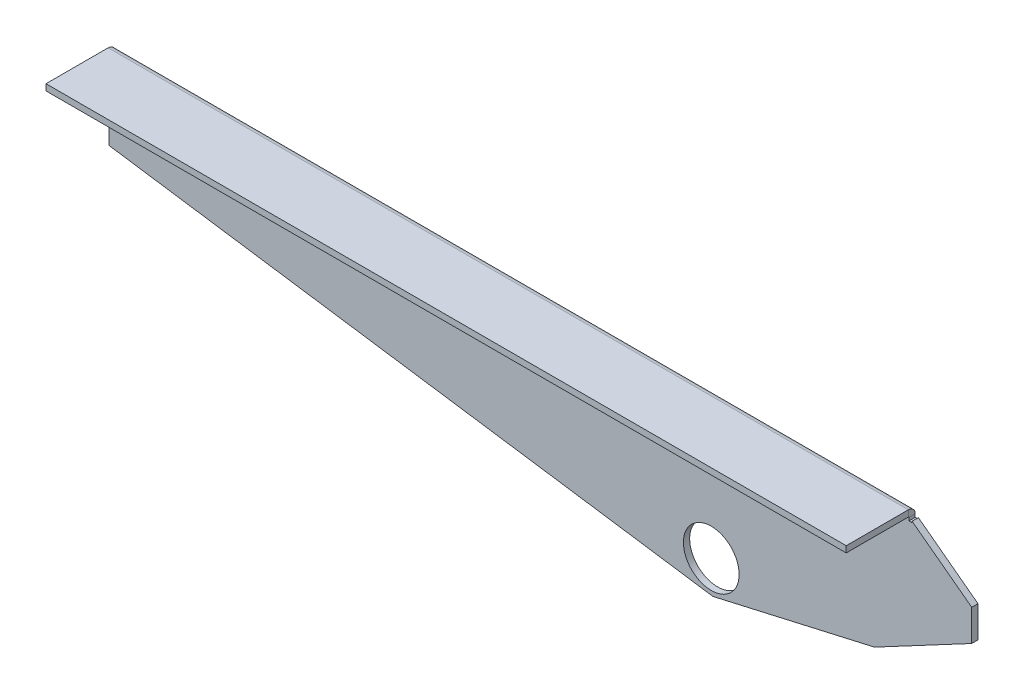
ISO-10303-21;
HEADER;
FILE_DESCRIPTION(('STEP AP214'),'2;1');
FILE_NAME('part.step','',(''),(''),'','','');
FILE_SCHEMA(('AUTOMOTIVE_DESIGN { 1 0 10303 214 1 1 1 1 }'));
ENDSEC;
DATA;
#1=APPLICATION_CONTEXT('core data for automotive mechanical design processes');
#2=APPLICATION_PROTOCOL_DEFINITION('international standard','automotive_design',2000,#1);
#3=PRODUCT_CONTEXT('',#1,'mechanical');
#4=PRODUCT('Part','Part','',(#3));
#5=PRODUCT_RELATED_PRODUCT_CATEGORY('part','',(#4));
#6=PRODUCT_DEFINITION_FORMATION('','',#4);
#7=PRODUCT_DEFINITION_CONTEXT('part definition',#1,'design');
#8=PRODUCT_DEFINITION('design','',#6,#7);
#9=PRODUCT_DEFINITION_SHAPE('','',#8);
#10=(LENGTH_UNIT() NAMED_UNIT(*) SI_UNIT(.MILLI.,.METRE.));
#11=(NAMED_UNIT(*) PLANE_ANGLE_UNIT() SI_UNIT($,.RADIAN.));
#12=(NAMED_UNIT(*) SI_UNIT($,.STERADIAN.) SOLID_ANGLE_UNIT());
#13=UNCERTAINTY_MEASURE_WITH_UNIT(LENGTH_MEASURE(1.E-05),#10,'distance_accuracy_value','');
#14=(GEOMETRIC_REPRESENTATION_CONTEXT(3) GLOBAL_UNCERTAINTY_ASSIGNED_CONTEXT((#13)) GLOBAL_UNIT_ASSIGNED_CONTEXT((#10,
#11,#12)) REPRESENTATION_CONTEXT('',''));
#15=CARTESIAN_POINT('',(0.,0.,0.));
#16=DIRECTION('',(0.,0.,1.));
#17=DIRECTION('',(1.,0.,0.));
#18=AXIS2_PLACEMENT_3D('',#15,#16,#17);
#19=CARTESIAN_POINT('',(0.,0.,8.));
#20=DIRECTION('',(0.,0.,-1.));
#21=DIRECTION('',(-1.,0.,0.));
#22=AXIS2_PLACEMENT_3D('',#19,#20,#21);
#23=PLANE('',#22);
#24=CARTESIAN_POINT('',(768.,-172.,8.));
#25=DIRECTION('',(0.,0.,1.));
#26=DIRECTION('',(1.,0.,0.));
#27=AXIS2_PLACEMENT_3D('',#24,#25,#26);
#28=CIRCLE('',#27,35.5);
#29=CARTESIAN_POINT('',(803.5,-172.,8.));
#30=VERTEX_POINT('',#29);
#31=EDGE_CURVE('E227',#30,#30,#28,.T.);
#32=ORIENTED_EDGE('',*,*,#31,.F.);
#33=EDGE_LOOP('',(#32));
#34=FACE_BOUND('',#33,.T.);
#35=DIRECTION('',(-1.,0.,0.));
#36=VECTOR('',#35,1.);
#37=CARTESIAN_POINT('',(0.,-0.736599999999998,7.99999999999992));
#38=LINE('',#37,#36);
#39=CARTESIAN_POINT('',(0.,-0.736599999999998,7.99999999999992));
#40=VERTEX_POINT('',#39);
#41=CARTESIAN_POINT('',(1020.,-0.736600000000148,7.99999999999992));
#42=VERTEX_POINT('',#41);
#43=EDGE_CURVE('E189',#40,#42,#38,.F.);
#44=ORIENTED_EDGE('',*,*,#43,.F.);
#45=DIRECTION('',(0.,-1.,0.));
#46=VECTOR('',#45,1.);
#47=CARTESIAN_POINT('',(0.,-100.,8.));
#48=LINE('',#47,#46);
#49=CARTESIAN_POINT('',(0.,-100.,8.));
#50=VERTEX_POINT('',#49);
#51=EDGE_CURVE('E242',#40,#50,#48,.T.);
#52=ORIENTED_EDGE('',*,*,#51,.T.);
#53=DIRECTION('',(0.989402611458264,-0.145198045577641,0.));
#54=VECTOR('',#53,1.);
#55=CARTESIAN_POINT('',(770.,-213.,8.));
#56=LINE('',#55,#54);
#57=CARTESIAN_POINT('',(770.,-213.,8.));
#58=VERTEX_POINT('',#57);
#59=EDGE_CURVE('E244',#50,#58,#56,.T.);
#60=ORIENTED_EDGE('',*,*,#59,.T.);
#61=DIRECTION('',(0.974946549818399,0.222439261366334,0.));
#62=VECTOR('',#61,1.);
#63=CARTESIAN_POINT('',(976.,-166.,8.));
#64=LINE('',#63,#62);
#65=CARTESIAN_POINT('',(976.,-166.,8.));
#66=VERTEX_POINT('',#65);
#67=EDGE_CURVE('E246',#58,#66,#64,.T.);
#68=ORIENTED_EDGE('',*,*,#67,.T.);
#69=DIRECTION('',(0.882746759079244,0.469849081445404,0.));
#70=VECTOR('',#69,1.);
#71=CARTESIAN_POINT('',(1100.,-100.,8.));
#72=LINE('',#71,#70);
#73=CARTESIAN_POINT('',(1100.,-100.,8.));
#74=VERTEX_POINT('',#73);
#75=EDGE_CURVE('E248',#66,#74,#72,.T.);
#76=ORIENTED_EDGE('',*,*,#75,.T.);
#77=DIRECTION('',(0.,1.,0.));
#78=VECTOR('',#77,1.);
#79=CARTESIAN_POINT('',(1100.,-60.,8.));
#80=LINE('',#79,#78);
#81=CARTESIAN_POINT('',(1100.,-60.,8.));
#82=VERTEX_POINT('',#81);
#83=EDGE_CURVE('E250',#74,#82,#80,.T.);
#84=ORIENTED_EDGE('',*,*,#83,.T.);
#85=DIRECTION('',(-0.8,0.6,0.));
#86=VECTOR('',#85,1.);
#87=CARTESIAN_POINT('',(1020.,0.,8.));
#88=LINE('',#87,#86);
#89=CARTESIAN_POINT('',(1024.,-3.,8.));
#90=VERTEX_POINT('',#89);
#91=EDGE_CURVE('E252',#82,#90,#88,.T.);
#92=ORIENTED_EDGE('',*,*,#91,.T.);
#93=DIRECTION('',(0.,1.,0.));
#94=VECTOR('',#93,1.);
#95=CARTESIAN_POINT('',(1024.,-4.73660000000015,7.99999999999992));
#96=LINE('',#95,#94);
#97=CARTESIAN_POINT('',(1024.,-4.73660000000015,8.));
#98=VERTEX_POINT('',#97);
#99=EDGE_CURVE('E67',#98,#90,#96,.T.);
#100=ORIENTED_EDGE('',*,*,#99,.F.);
#101=DIRECTION('',(1.,0.,0.));
#102=VECTOR('',#101,1.);
#103=CARTESIAN_POINT('',(1020.,-4.73660000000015,7.99999999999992));
#104=LINE('',#103,#102);
#105=CARTESIAN_POINT('',(1020.,-4.73660000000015,8.));
#106=VERTEX_POINT('',#105);
#107=EDGE_CURVE('E62',#106,#98,#104,.T.);
#108=ORIENTED_EDGE('',*,*,#107,.F.);
#109=DIRECTION('',(0.,-1.,0.));
#110=VECTOR('',#109,1.);
#111=CARTESIAN_POINT('',(1020.,-0.736600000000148,7.99999999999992));
#112=LINE('',#111,#110);
#113=EDGE_CURVE('E208',#42,#106,#112,.T.);
#114=ORIENTED_EDGE('',*,*,#113,.F.);
#115=EDGE_LOOP('',(#44,#52,#60,#68,#76,#84,#92,#100,#108,#114));
#116=FACE_BOUND('',#115,.T.);
#117=ADVANCED_FACE('F47',(#34,#116),#23,.F.);
#118=CARTESIAN_POINT('',(0.,0.,0.));
#119=DIRECTION('',(0.,0.,-1.));
#120=DIRECTION('',(-1.,0.,0.));
#121=AXIS2_PLACEMENT_3D('',#118,#119,#120);
#122=PLANE('',#121);
#123=CARTESIAN_POINT('',(768.,-172.,0.));
#124=DIRECTION('',(0.,0.,1.));
#125=DIRECTION('',(1.,0.,0.));
#126=AXIS2_PLACEMENT_3D('',#123,#124,#125);
#127=CIRCLE('',#126,35.5);
#128=CARTESIAN_POINT('',(803.5,-172.,0.));
#129=VERTEX_POINT('',#128);
#130=EDGE_CURVE('E224',#129,#129,#127,.T.);
#131=ORIENTED_EDGE('',*,*,#130,.T.);
#132=EDGE_LOOP('',(#131));
#133=FACE_BOUND('',#132,.T.);
#134=DIRECTION('',(0.,-1.,0.));
#135=VECTOR('',#134,1.);
#136=CARTESIAN_POINT('',(0.,-100.,0.));
#137=LINE('',#136,#135);
#138=CARTESIAN_POINT('',(0.,-0.736600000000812,0.));
#139=VERTEX_POINT('',#138);
#140=CARTESIAN_POINT('',(0.,-100.,0.));
#141=VERTEX_POINT('',#140);
#142=EDGE_CURVE('E230',#139,#141,#137,.T.);
#143=ORIENTED_EDGE('',*,*,#142,.F.);
#144=DIRECTION('',(-1.,0.,0.));
#145=VECTOR('',#144,1.);
#146=CARTESIAN_POINT('',(0.,-0.736600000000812,0.));
#147=LINE('',#146,#145);
#148=CARTESIAN_POINT('',(1020.,-0.736600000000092,0.));
#149=VERTEX_POINT('',#148);
#150=EDGE_CURVE('E193',#139,#149,#147,.F.);
#151=ORIENTED_EDGE('',*,*,#150,.T.);
#152=DIRECTION('',(0.,-1.,0.));
#153=VECTOR('',#152,1.);
#154=CARTESIAN_POINT('',(1020.,0.,0.));
#155=LINE('',#154,#153);
#156=CARTESIAN_POINT('',(1020.,-4.73660000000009,0.));
#157=VERTEX_POINT('',#156);
#158=EDGE_CURVE('E11',#149,#157,#155,.T.);
#159=ORIENTED_EDGE('',*,*,#158,.T.);
#160=DIRECTION('',(1.,0.,0.));
#161=VECTOR('',#160,1.);
#162=CARTESIAN_POINT('',(0.,-4.73660000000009,0.));
#163=LINE('',#162,#161);
#164=CARTESIAN_POINT('',(1024.,-4.73660000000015,0.));
#165=VERTEX_POINT('',#164);
#166=EDGE_CURVE('E55',#157,#165,#163,.T.);
#167=ORIENTED_EDGE('',*,*,#166,.T.);
#168=DIRECTION('',(0.,1.,0.));
#169=VECTOR('',#168,1.);
#170=CARTESIAN_POINT('',(1024.,0.,0.));
#171=LINE('',#170,#169);
#172=CARTESIAN_POINT('',(1024.,-2.99999999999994,0.));
#173=VERTEX_POINT('',#172);
#174=EDGE_CURVE('E211',#165,#173,#171,.T.);
#175=ORIENTED_EDGE('',*,*,#174,.T.);
#176=DIRECTION('',(-0.8,0.6,0.));
#177=VECTOR('',#176,1.);
#178=CARTESIAN_POINT('',(1020.,0.,0.));
#179=LINE('',#178,#177);
#180=CARTESIAN_POINT('',(1100.,-60.,0.));
#181=VERTEX_POINT('',#180);
#182=EDGE_CURVE('E240',#181,#173,#179,.T.);
#183=ORIENTED_EDGE('',*,*,#182,.F.);
#184=DIRECTION('',(0.,1.,0.));
#185=VECTOR('',#184,1.);
#186=CARTESIAN_POINT('',(1100.,-60.,0.));
#187=LINE('',#186,#185);
#188=CARTESIAN_POINT('',(1100.,-100.,0.));
#189=VERTEX_POINT('',#188);
#190=EDGE_CURVE('E238',#189,#181,#187,.T.);
#191=ORIENTED_EDGE('',*,*,#190,.F.);
#192=DIRECTION('',(0.882746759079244,0.469849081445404,0.));
#193=VECTOR('',#192,1.);
#194=CARTESIAN_POINT('',(1100.,-100.,0.));
#195=LINE('',#194,#193);
#196=CARTESIAN_POINT('',(976.,-166.,0.));
#197=VERTEX_POINT('',#196);
#198=EDGE_CURVE('E236',#197,#189,#195,.T.);
#199=ORIENTED_EDGE('',*,*,#198,.F.);
#200=DIRECTION('',(0.974946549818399,0.222439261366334,0.));
#201=VECTOR('',#200,1.);
#202=CARTESIAN_POINT('',(976.,-166.,0.));
#203=LINE('',#202,#201);
#204=CARTESIAN_POINT('',(770.,-213.,0.));
#205=VERTEX_POINT('',#204);
#206=EDGE_CURVE('E234',#205,#197,#203,.T.);
#207=ORIENTED_EDGE('',*,*,#206,.F.);
#208=DIRECTION('',(0.989402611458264,-0.145198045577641,0.));
#209=VECTOR('',#208,1.);
#210=CARTESIAN_POINT('',(770.,-213.,0.));
#211=LINE('',#210,#209);
#212=EDGE_CURVE('E232',#141,#205,#211,.T.);
#213=ORIENTED_EDGE('',*,*,#212,.F.);
#214=EDGE_LOOP('',(#143,#151,#159,#167,#175,#183,#191,#199,#207,#213));
#215=FACE_BOUND('',#214,.T.);
#216=ADVANCED_FACE('F272',(#133,#215),#122,.T.);
#217=CARTESIAN_POINT('',(0.,-100.,8.));
#218=DIRECTION('',(1.,0.,0.));
#219=DIRECTION('',(0.,0.,-1.));
#220=AXIS2_PLACEMENT_3D('',#217,#218,#219);
#221=PLANE('',#220);
#222=DIRECTION('',(0.,-1.01855539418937E-13,-1.));
#223=VECTOR('',#222,1.);
#224=CARTESIAN_POINT('',(0.,-0.736599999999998,7.99999999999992));
#225=LINE('',#224,#223);
#226=EDGE_CURVE('E199',#40,#139,#225,.T.);
#227=ORIENTED_EDGE('',*,*,#226,.T.);
#228=ORIENTED_EDGE('',*,*,#142,.T.);
#229=DIRECTION('',(0.,0.,-1.));
#230=VECTOR('',#229,1.);
#231=CARTESIAN_POINT('',(0.,-100.,8.));
#232=LINE('',#231,#230);
#233=EDGE_CURVE('E266',#50,#141,#232,.T.);
#234=ORIENTED_EDGE('',*,*,#233,.F.);
#235=ORIENTED_EDGE('',*,*,#51,.F.);
#236=EDGE_LOOP('',(#227,#228,#234,#235));
#237=FACE_BOUND('',#236,.T.);
#238=ADVANCED_FACE('F49',(#237),#221,.F.);
#239=CARTESIAN_POINT('',(1020.,0.,8.));
#240=DIRECTION('',(-0.6,-0.8,0.));
#241=DIRECTION('',(0.8,-0.6,0.));
#242=AXIS2_PLACEMENT_3D('',#239,#240,#241);
#243=PLANE('',#242);
#244=DIRECTION('',(0.,0.,-1.));
#245=VECTOR('',#244,1.);
#246=CARTESIAN_POINT('',(1024.,-3.,7.99999999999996));
#247=LINE('',#246,#245);
#248=EDGE_CURVE('E215',#90,#173,#247,.T.);
#249=ORIENTED_EDGE('',*,*,#248,.F.);
#250=ORIENTED_EDGE('',*,*,#91,.F.);
#251=DIRECTION('',(0.,0.,-1.));
#252=VECTOR('',#251,1.);
#253=CARTESIAN_POINT('',(1100.,-60.,8.));
#254=LINE('',#253,#252);
#255=EDGE_CURVE('E254',#82,#181,#254,.T.);
#256=ORIENTED_EDGE('',*,*,#255,.T.);
#257=ORIENTED_EDGE('',*,*,#182,.T.);
#258=EDGE_LOOP('',(#249,#250,#256,#257));
#259=FACE_BOUND('',#258,.T.);
#260=ADVANCED_FACE('F310',(#259),#243,.F.);
#261=CARTESIAN_POINT('',(770.,-213.,8.));
#262=DIRECTION('',(0.145198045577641,0.989402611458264,0.));
#263=DIRECTION('',(-0.989402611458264,0.145198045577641,0.));
#264=AXIS2_PLACEMENT_3D('',#261,#262,#263);
#265=PLANE('',#264);
#266=ORIENTED_EDGE('',*,*,#212,.T.);
#267=DIRECTION('',(0.,0.,-1.));
#268=VECTOR('',#267,1.);
#269=CARTESIAN_POINT('',(770.,-213.,8.));
#270=LINE('',#269,#268);
#271=EDGE_CURVE('E263',#58,#205,#270,.T.);
#272=ORIENTED_EDGE('',*,*,#271,.F.);
#273=ORIENTED_EDGE('',*,*,#59,.F.);
#274=ORIENTED_EDGE('',*,*,#233,.T.);
#275=EDGE_LOOP('',(#266,#272,#273,#274));
#276=FACE_BOUND('',#275,.T.);
#277=ADVANCED_FACE('F291',(#276),#265,.F.);
#278=CARTESIAN_POINT('',(976.,-166.,8.));
#279=DIRECTION('',(-0.222439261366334,0.974946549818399,0.));
#280=DIRECTION('',(-0.974946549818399,-0.222439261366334,0.));
#281=AXIS2_PLACEMENT_3D('',#278,#279,#280);
#282=PLANE('',#281);
#283=ORIENTED_EDGE('',*,*,#206,.T.);
#284=DIRECTION('',(0.,0.,-1.));
#285=VECTOR('',#284,1.);
#286=CARTESIAN_POINT('',(976.,-166.,8.));
#287=LINE('',#286,#285);
#288=EDGE_CURVE('E260',#66,#197,#287,.T.);
#289=ORIENTED_EDGE('',*,*,#288,.F.);
#290=ORIENTED_EDGE('',*,*,#67,.F.);
#291=ORIENTED_EDGE('',*,*,#271,.T.);
#292=EDGE_LOOP('',(#283,#289,#290,#291));
#293=FACE_BOUND('',#292,.T.);
#294=ADVANCED_FACE('F298',(#293),#282,.F.);
#295=CARTESIAN_POINT('',(1100.,-100.,8.));
#296=DIRECTION('',(-0.469849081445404,0.882746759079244,0.));
#297=DIRECTION('',(-0.882746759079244,-0.469849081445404,0.));
#298=AXIS2_PLACEMENT_3D('',#295,#296,#297);
#299=PLANE('',#298);
#300=ORIENTED_EDGE('',*,*,#198,.T.);
#301=DIRECTION('',(0.,0.,-1.));
#302=VECTOR('',#301,1.);
#303=CARTESIAN_POINT('',(1100.,-100.,8.));
#304=LINE('',#303,#302);
#305=EDGE_CURVE('E257',#74,#189,#304,.T.);
#306=ORIENTED_EDGE('',*,*,#305,.F.);
#307=ORIENTED_EDGE('',*,*,#75,.F.);
#308=ORIENTED_EDGE('',*,*,#288,.T.);
#309=EDGE_LOOP('',(#300,#306,#307,#308));
#310=FACE_BOUND('',#309,.T.);
#311=ADVANCED_FACE('F302',(#310),#299,.F.);
#312=CARTESIAN_POINT('',(1100.,-60.,8.));
#313=DIRECTION('',(-1.,0.,0.));
#314=DIRECTION('',(0.,0.,1.));
#315=AXIS2_PLACEMENT_3D('',#312,#313,#314);
#316=PLANE('',#315);
#317=ORIENTED_EDGE('',*,*,#190,.T.);
#318=ORIENTED_EDGE('',*,*,#255,.F.);
#319=ORIENTED_EDGE('',*,*,#83,.F.);
#320=ORIENTED_EDGE('',*,*,#305,.T.);
#321=EDGE_LOOP('',(#317,#318,#319,#320));
#322=FACE_BOUND('',#321,.T.);
#323=ADVANCED_FACE('F307',(#322),#316,.F.);
#324=CARTESIAN_POINT('',(768.,-172.,8.));
#325=DIRECTION('',(0.,0.,-1.));
#326=DIRECTION('',(-1.,0.,0.));
#327=AXIS2_PLACEMENT_3D('',#324,#325,#326);
#328=CYLINDRICAL_SURFACE('',#327,35.5);
#329=ORIENTED_EDGE('',*,*,#31,.T.);
#330=EDGE_LOOP('',(#329));
#331=FACE_BOUND('',#330,.T.);
#332=ORIENTED_EDGE('',*,*,#130,.F.);
#333=EDGE_LOOP('',(#332));
#334=FACE_BOUND('',#333,.T.);
#335=ADVANCED_FACE('F353',(#331,#334),#328,.F.);
#336=CARTESIAN_POINT('',(1020.,-0.736600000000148,7.99999999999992));
#337=DIRECTION('',(1.,0.,0.));
#338=DIRECTION('',(0.,0.,-1.));
#339=AXIS2_PLACEMENT_3D('',#336,#337,#338);
#340=PLANE('',#339);
#341=ORIENTED_EDGE('',*,*,#158,.F.);
#342=DIRECTION('',(0.,-1.01893705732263E-13,-1.));
#343=VECTOR('',#342,1.);
#344=CARTESIAN_POINT('',(1020.,-0.736600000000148,7.99999999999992));
#345=LINE('',#344,#343);
#346=EDGE_CURVE('E202',#42,#149,#345,.T.);
#347=ORIENTED_EDGE('',*,*,#346,.F.);
#348=ORIENTED_EDGE('',*,*,#113,.T.);
#349=DIRECTION('',(0.,0.,-1.));
#350=VECTOR('',#349,1.);
#351=CARTESIAN_POINT('',(1020.,-4.73660000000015,7.99999999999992));
#352=LINE('',#351,#350);
#353=EDGE_CURVE('E213',#106,#157,#352,.T.);
#354=ORIENTED_EDGE('',*,*,#353,.T.);
#355=EDGE_LOOP('',(#341,#347,#348,#354));
#356=FACE_BOUND('',#355,.T.);
#357=ADVANCED_FACE('F281',(#356),#340,.T.);
#358=CARTESIAN_POINT('',(1020.,-4.73660000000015,7.99999999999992));
#359=DIRECTION('',(0.,1.,0.));
#360=DIRECTION('',(0.,0.,1.));
#361=AXIS2_PLACEMENT_3D('',#358,#359,#360);
#362=PLANE('',#361);
#363=ORIENTED_EDGE('',*,*,#166,.F.);
#364=ORIENTED_EDGE('',*,*,#353,.F.);
#365=ORIENTED_EDGE('',*,*,#107,.T.);
#366=DIRECTION('',(0.,0.,-1.));
#367=VECTOR('',#366,1.);
#368=CARTESIAN_POINT('',(1024.,-4.73660000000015,7.99999999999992));
#369=LINE('',#368,#367);
#370=EDGE_CURVE('E205',#98,#165,#369,.T.);
#371=ORIENTED_EDGE('',*,*,#370,.T.);
#372=EDGE_LOOP('',(#363,#364,#365,#371));
#373=FACE_BOUND('',#372,.T.);
#374=ADVANCED_FACE('F278',(#373),#362,.T.);
#375=CARTESIAN_POINT('',(1024.,-4.73660000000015,7.99999999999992));
#376=DIRECTION('',(-1.,0.,0.));
#377=DIRECTION('',(0.,0.,1.));
#378=AXIS2_PLACEMENT_3D('',#375,#376,#377);
#379=PLANE('',#378);
#380=ORIENTED_EDGE('',*,*,#174,.F.);
#381=ORIENTED_EDGE('',*,*,#370,.F.);
#382=ORIENTED_EDGE('',*,*,#99,.T.);
#383=ORIENTED_EDGE('',*,*,#248,.T.);
#384=EDGE_LOOP('',(#380,#381,#382,#383));
#385=FACE_BOUND('',#384,.T.);
#386=ADVANCED_FACE('F277',(#385),#379,.T.);
#387=CARTESIAN_POINT('',(1020.,-0.736600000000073,8.7366));
#388=DIRECTION('',(1.,0.,0.));
#389=DIRECTION('',(0.,1.,0.));
#390=AXIS2_PLACEMENT_3D('',#387,#388,#389);
#391=PLANE('',#390);
#392=DIRECTION('',(0.,1.,0.));
#393=VECTOR('',#392,1.);
#394=CARTESIAN_POINT('',(1020.,0.,8.7366));
#395=LINE('',#394,#393);
#396=CARTESIAN_POINT('',(1020.,0.,8.7366));
#397=VERTEX_POINT('',#396);
#398=CARTESIAN_POINT('',(1020.,8.,8.73659999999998));
#399=VERTEX_POINT('',#398);
#400=EDGE_CURVE('E493',#397,#399,#395,.T.);
#401=ORIENTED_EDGE('',*,*,#400,.F.);
#402=CARTESIAN_POINT('',(1020.,-0.736600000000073,8.7366));
#403=DIRECTION('',(-1.,0.,0.));
#404=DIRECTION('',(0.,-1.,0.));
#405=AXIS2_PLACEMENT_3D('',#402,#403,#404);
#406=CIRCLE('',#405,0.736600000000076);
#407=EDGE_CURVE('E185',#42,#397,#406,.F.);
#408=ORIENTED_EDGE('',*,*,#407,.F.);
#409=ORIENTED_EDGE('',*,*,#346,.T.);
#410=CARTESIAN_POINT('',(1020.,-0.736600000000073,8.7366));
#411=DIRECTION('',(-1.,0.,0.));
#412=DIRECTION('',(0.,-1.,0.));
#413=AXIS2_PLACEMENT_3D('',#410,#411,#412);
#414=CIRCLE('',#413,8.73660000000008);
#415=EDGE_CURVE('E196',#149,#399,#414,.F.);
#416=ORIENTED_EDGE('',*,*,#415,.T.);
#417=EDGE_LOOP('',(#401,#408,#409,#416));
#418=FACE_BOUND('',#417,.T.);
#419=ADVANCED_FACE('F413',(#418),#391,.T.);
#420=CARTESIAN_POINT('',(0.,-0.736599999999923,8.7366));
#421=DIRECTION('',(1.,0.,0.));
#422=DIRECTION('',(0.,1.,0.));
#423=AXIS2_PLACEMENT_3D('',#420,#421,#422);
#424=PLANE('',#423);
#425=CARTESIAN_POINT('',(0.,-0.736599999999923,8.7366));
#426=DIRECTION('',(-1.,0.,0.));
#427=DIRECTION('',(0.,-1.,0.));
#428=AXIS2_PLACEMENT_3D('',#425,#426,#427);
#429=CIRCLE('',#428,0.736600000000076);
#430=CARTESIAN_POINT('',(0.,1.52655665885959E-13,8.7366));
#431=VERTEX_POINT('',#430);
#432=EDGE_CURVE('E183',#431,#40,#429,.T.);
#433=ORIENTED_EDGE('',*,*,#432,.F.);
#434=DIRECTION('',(0.,1.,0.));
#435=VECTOR('',#434,1.);
#436=CARTESIAN_POINT('',(0.,0.,8.7366));
#437=LINE('',#436,#435);
#438=CARTESIAN_POINT('',(0.,8.,8.73659999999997));
#439=VERTEX_POINT('',#438);
#440=EDGE_CURVE('E318',#431,#439,#437,.T.);
#441=ORIENTED_EDGE('',*,*,#440,.T.);
#442=CARTESIAN_POINT('',(0.,-0.736599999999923,8.7366));
#443=DIRECTION('',(-1.,0.,0.));
#444=DIRECTION('',(0.,-1.,0.));
#445=AXIS2_PLACEMENT_3D('',#442,#443,#444);
#446=CIRCLE('',#445,8.73660000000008);
#447=EDGE_CURVE('E188',#439,#139,#446,.T.);
#448=ORIENTED_EDGE('',*,*,#447,.T.);
#449=ORIENTED_EDGE('',*,*,#226,.F.);
#450=EDGE_LOOP('',(#433,#441,#448,#449));
#451=FACE_BOUND('',#450,.T.);
#452=ADVANCED_FACE('F316',(#451),#424,.F.);
#453=CARTESIAN_POINT('',(0.,-0.736599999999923,8.7366));
#454=DIRECTION('',(-1.,0.,0.));
#455=DIRECTION('',(0.,1.,0.));
#456=AXIS2_PLACEMENT_3D('',#453,#454,#455);
#457=CYLINDRICAL_SURFACE('',#456,8.73660000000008);
#458=ORIENTED_EDGE('',*,*,#150,.F.);
#459=ORIENTED_EDGE('',*,*,#447,.F.);
#460=DIRECTION('',(-1.,0.,0.));
#461=VECTOR('',#460,1.);
#462=CARTESIAN_POINT('',(0.,8.,8.73659999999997));
#463=LINE('',#462,#461);
#464=EDGE_CURVE('E159',#399,#439,#463,.T.);
#465=ORIENTED_EDGE('',*,*,#464,.F.);
#466=ORIENTED_EDGE('',*,*,#415,.F.);
#467=EDGE_LOOP('',(#458,#459,#465,#466));
#468=FACE_BOUND('',#467,.T.);
#469=ADVANCED_FACE('F312',(#468),#457,.T.);
#470=CARTESIAN_POINT('',(0.,-0.736599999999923,8.7366));
#471=DIRECTION('',(-1.,0.,0.));
#472=DIRECTION('',(0.,1.,0.));
#473=AXIS2_PLACEMENT_3D('',#470,#471,#472);
#474=CYLINDRICAL_SURFACE('',#473,0.736600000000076);
#475=ORIENTED_EDGE('',*,*,#43,.T.);
#476=ORIENTED_EDGE('',*,*,#407,.T.);
#477=DIRECTION('',(-1.,0.,0.));
#478=VECTOR('',#477,1.);
#479=CARTESIAN_POINT('',(1020.,0.,8.7366));
#480=LINE('',#479,#478);
#481=EDGE_CURVE('E156',#397,#431,#480,.T.);
#482=ORIENTED_EDGE('',*,*,#481,.T.);
#483=ORIENTED_EDGE('',*,*,#432,.T.);
#484=EDGE_LOOP('',(#475,#476,#482,#483));
#485=FACE_BOUND('',#484,.T.);
#486=ADVANCED_FACE('F327',(#485),#474,.F.);
#487=CARTESIAN_POINT('',(0.,8.,7.99999999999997));
#488=DIRECTION('',(-1.,0.,0.));
#489=DIRECTION('',(0.,0.,1.));
#490=AXIS2_PLACEMENT_3D('',#487,#488,#489);
#491=PLANE('',#490);
#492=DIRECTION('',(0.,0.,-1.));
#493=VECTOR('',#492,1.);
#494=CARTESIAN_POINT('',(0.,8.,7.99999999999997));
#495=LINE('',#494,#493);
#496=CARTESIAN_POINT('',(0.,8.00000000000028,88.));
#497=VERTEX_POINT('',#496);
#498=EDGE_CURVE('E170',#497,#439,#495,.T.);
#499=ORIENTED_EDGE('',*,*,#498,.T.);
#500=ORIENTED_EDGE('',*,*,#440,.F.);
#501=DIRECTION('',(0.,0.,-1.));
#502=VECTOR('',#501,1.);
#503=CARTESIAN_POINT('',(0.,0.,8.));
#504=LINE('',#503,#502);
#505=CARTESIAN_POINT('',(0.,2.79318668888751E-13,88.));
#506=VERTEX_POINT('',#505);
#507=EDGE_CURVE('E173',#506,#431,#504,.T.);
#508=ORIENTED_EDGE('',*,*,#507,.F.);
#509=DIRECTION('',(0.,-1.,0.));
#510=VECTOR('',#509,1.);
#511=CARTESIAN_POINT('',(0.,8.00000000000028,88.));
#512=LINE('',#511,#510);
#513=EDGE_CURVE('E169',#497,#506,#512,.T.);
#514=ORIENTED_EDGE('',*,*,#513,.F.);
#515=EDGE_LOOP('',(#499,#500,#508,#514));
#516=FACE_BOUND('',#515,.T.);
#517=ADVANCED_FACE('F325',(#516),#491,.T.);
#518=CARTESIAN_POINT('',(1020.,8.00000000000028,88.));
#519=DIRECTION('',(1.,0.,0.));
#520=DIRECTION('',(0.,0.,-1.));
#521=AXIS2_PLACEMENT_3D('',#518,#519,#520);
#522=PLANE('',#521);
#523=DIRECTION('',(0.,0.,1.));
#524=VECTOR('',#523,1.);
#525=CARTESIAN_POINT('',(1020.,2.79318668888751E-13,88.));
#526=LINE('',#525,#524);
#527=CARTESIAN_POINT('',(1020.,2.79318668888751E-13,88.));
#528=VERTEX_POINT('',#527);
#529=EDGE_CURVE('E149',#397,#528,#526,.T.);
#530=ORIENTED_EDGE('',*,*,#529,.F.);
#531=ORIENTED_EDGE('',*,*,#400,.T.);
#532=DIRECTION('',(0.,0.,1.));
#533=VECTOR('',#532,1.);
#534=CARTESIAN_POINT('',(1020.,8.00000000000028,88.));
#535=LINE('',#534,#533);
#536=CARTESIAN_POINT('',(1020.,8.00000000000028,88.));
#537=VERTEX_POINT('',#536);
#538=EDGE_CURVE('E165',#399,#537,#535,.T.);
#539=ORIENTED_EDGE('',*,*,#538,.T.);
#540=DIRECTION('',(0.,-1.,0.));
#541=VECTOR('',#540,1.);
#542=CARTESIAN_POINT('',(1020.,8.00000000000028,88.));
#543=LINE('',#542,#541);
#544=EDGE_CURVE('E162',#537,#528,#543,.T.);
#545=ORIENTED_EDGE('',*,*,#544,.T.);
#546=EDGE_LOOP('',(#530,#531,#539,#545));
#547=FACE_BOUND('',#546,.T.);
#548=ADVANCED_FACE('F163',(#547),#522,.T.);
#549=CARTESIAN_POINT('',(0.,8.,7.99999999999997));
#550=DIRECTION('',(0.,1.,0.));
#551=DIRECTION('',(0.,0.,1.));
#552=AXIS2_PLACEMENT_3D('',#549,#550,#551);
#553=PLANE('',#552);
#554=ORIENTED_EDGE('',*,*,#538,.F.);
#555=ORIENTED_EDGE('',*,*,#464,.T.);
#556=ORIENTED_EDGE('',*,*,#498,.F.);
#557=DIRECTION('',(-1.,0.,0.));
#558=VECTOR('',#557,1.);
#559=CARTESIAN_POINT('',(0.,8.00000000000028,88.));
#560=LINE('',#559,#558);
#561=EDGE_CURVE('E179',#537,#497,#560,.T.);
#562=ORIENTED_EDGE('',*,*,#561,.F.);
#563=EDGE_LOOP('',(#554,#555,#556,#562));
#564=FACE_BOUND('',#563,.T.);
#565=ADVANCED_FACE('F324',(#564),#553,.T.);
#566=CARTESIAN_POINT('',(0.,0.,8.));
#567=DIRECTION('',(0.,1.,0.));
#568=DIRECTION('',(0.,0.,1.));
#569=AXIS2_PLACEMENT_3D('',#566,#567,#568);
#570=PLANE('',#569);
#571=ORIENTED_EDGE('',*,*,#481,.F.);
#572=ORIENTED_EDGE('',*,*,#529,.T.);
#573=DIRECTION('',(-1.,0.,0.));
#574=VECTOR('',#573,1.);
#575=CARTESIAN_POINT('',(0.,2.79318668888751E-13,88.));
#576=LINE('',#575,#574);
#577=EDGE_CURVE('E154',#528,#506,#576,.T.);
#578=ORIENTED_EDGE('',*,*,#577,.T.);
#579=ORIENTED_EDGE('',*,*,#507,.T.);
#580=EDGE_LOOP('',(#571,#572,#578,#579));
#581=FACE_BOUND('',#580,.T.);
#582=ADVANCED_FACE('F151',(#581),#570,.F.);
#583=CARTESIAN_POINT('',(0.,8.00000000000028,88.));
#584=DIRECTION('',(0.,0.,1.));
#585=DIRECTION('',(0.,-1.,0.));
#586=AXIS2_PLACEMENT_3D('',#583,#584,#585);
#587=PLANE('',#586);
#588=ORIENTED_EDGE('',*,*,#577,.F.);
#589=ORIENTED_EDGE('',*,*,#544,.F.);
#590=ORIENTED_EDGE('',*,*,#561,.T.);
#591=ORIENTED_EDGE('',*,*,#513,.T.);
#592=EDGE_LOOP('',(#588,#589,#590,#591));
#593=FACE_BOUND('',#592,.T.);
#594=ADVANCED_FACE('F172',(#593),#587,.T.);
#595=CLOSED_SHELL('',(#117,#216,#238,#260,#277,#294,#311,#323,#335,#357,#374,#386,#419,#452,
#469,#486,#517,#548,#565,#582,#594));
#596=MANIFOLD_SOLID_BREP('B2',#595);
#597=ADVANCED_BREP_SHAPE_REPRESENTATION('',(#18,#596),#14);
#598=SHAPE_DEFINITION_REPRESENTATION(#9,#597);
ENDSEC;
END-ISO-10303-21;
